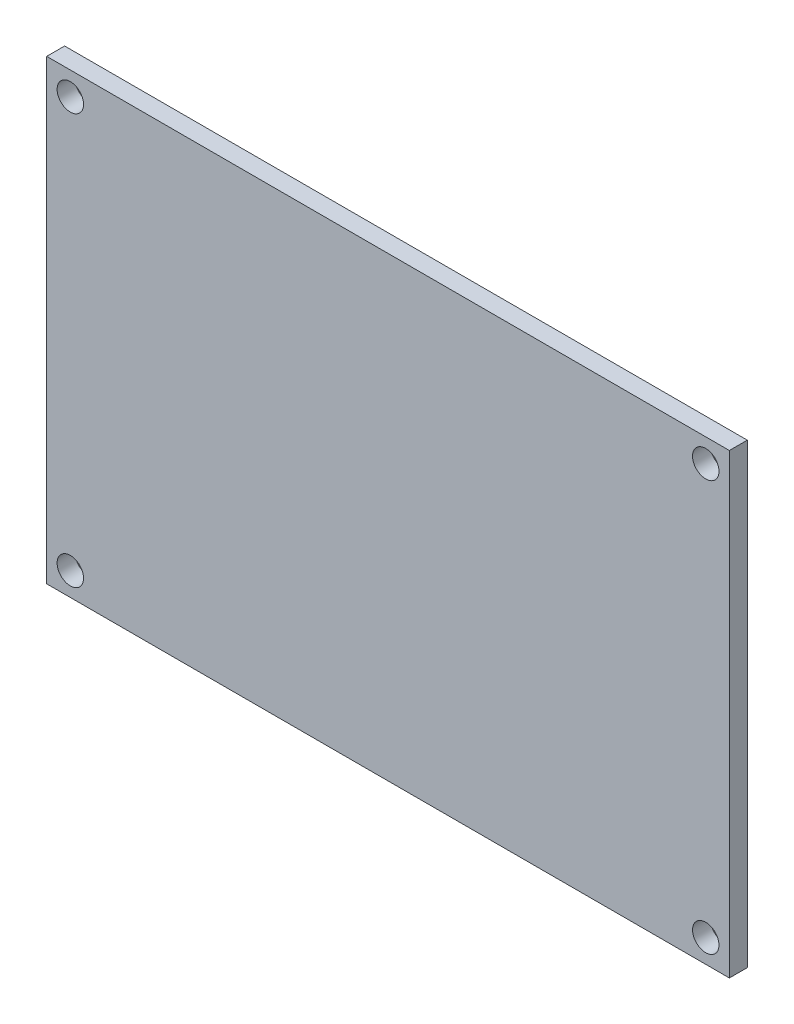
ISO-10303-21;
HEADER;
FILE_DESCRIPTION(('STEP AP214'),'2;1');
FILE_NAME('part.step','',(''),(''),'','','');
FILE_SCHEMA(('AUTOMOTIVE_DESIGN { 1 0 10303 214 1 1 1 1 }'));
ENDSEC;
DATA;
#1=APPLICATION_CONTEXT('core data for automotive mechanical design processes');
#2=APPLICATION_PROTOCOL_DEFINITION('international standard','automotive_design',2000,#1);
#3=PRODUCT_CONTEXT('',#1,'mechanical');
#4=PRODUCT('Part','Part','',(#3));
#5=PRODUCT_RELATED_PRODUCT_CATEGORY('part','',(#4));
#6=PRODUCT_DEFINITION_FORMATION('','',#4);
#7=PRODUCT_DEFINITION_CONTEXT('part definition',#1,'design');
#8=PRODUCT_DEFINITION('design','',#6,#7);
#9=PRODUCT_DEFINITION_SHAPE('','',#8);
#10=(LENGTH_UNIT() NAMED_UNIT(*) SI_UNIT(.MILLI.,.METRE.));
#11=(NAMED_UNIT(*) PLANE_ANGLE_UNIT() SI_UNIT($,.RADIAN.));
#12=(NAMED_UNIT(*) SI_UNIT($,.STERADIAN.) SOLID_ANGLE_UNIT());
#13=UNCERTAINTY_MEASURE_WITH_UNIT(LENGTH_MEASURE(1.E-05),#10,'distance_accuracy_value','');
#14=(GEOMETRIC_REPRESENTATION_CONTEXT(3) GLOBAL_UNCERTAINTY_ASSIGNED_CONTEXT((#13)) GLOBAL_UNIT_ASSIGNED_CONTEXT((#10,
#11,#12)) REPRESENTATION_CONTEXT('',''));
#15=CARTESIAN_POINT('',(0.,0.,0.));
#16=DIRECTION('',(0.,0.,1.));
#17=DIRECTION('',(1.,0.,0.));
#18=AXIS2_PLACEMENT_3D('',#15,#16,#17);
#19=CARTESIAN_POINT('',(0.,0.,1.5748));
#20=DIRECTION('',(0.,0.,1.));
#21=DIRECTION('',(1.,0.,0.));
#22=AXIS2_PLACEMENT_3D('',#19,#20,#21);
#23=PLANE('',#22);
#24=CARTESIAN_POINT('',(-27.9273,-18.034,1.5748));
#25=DIRECTION('',(0.,0.,1.));
#26=DIRECTION('',(1.,0.,0.));
#27=AXIS2_PLACEMENT_3D('',#24,#25,#26);
#28=CIRCLE('',#27,1.16205);
#29=CARTESIAN_POINT('',(-26.76525,-18.034,1.5748));
#30=VERTEX_POINT('',#29);
#31=EDGE_CURVE('E141',#30,#30,#28,.T.);
#32=ORIENTED_EDGE('',*,*,#31,.F.);
#33=EDGE_LOOP('',(#32));
#34=FACE_BOUND('',#33,.T.);
#35=CARTESIAN_POINT('',(27.9273,18.034,1.5748));
#36=DIRECTION('',(0.,0.,1.));
#37=DIRECTION('',(1.,0.,0.));
#38=AXIS2_PLACEMENT_3D('',#35,#36,#37);
#39=CIRCLE('',#38,1.16205);
#40=CARTESIAN_POINT('',(29.08935,18.034,1.5748));
#41=VERTEX_POINT('',#40);
#42=EDGE_CURVE('E115',#41,#41,#39,.T.);
#43=ORIENTED_EDGE('',*,*,#42,.F.);
#44=EDGE_LOOP('',(#43));
#45=FACE_BOUND('',#44,.T.);
#46=DIRECTION('',(0.,-1.,0.));
#47=VECTOR('',#46,1.);
#48=CARTESIAN_POINT('',(-30.00375,20.0787,1.5748));
#49=LINE('',#48,#47);
#50=CARTESIAN_POINT('',(-30.00375,20.0787,1.5748));
#51=VERTEX_POINT('',#50);
#52=CARTESIAN_POINT('',(-30.00375,-20.0787,1.5748));
#53=VERTEX_POINT('',#52);
#54=EDGE_CURVE('E94',#51,#53,#49,.T.);
#55=ORIENTED_EDGE('',*,*,#54,.T.);
#56=DIRECTION('',(1.,0.,0.));
#57=VECTOR('',#56,1.);
#58=CARTESIAN_POINT('',(-30.00375,-20.0787,1.5748));
#59=LINE('',#58,#57);
#60=CARTESIAN_POINT('',(30.00375,-20.0787,1.5748));
#61=VERTEX_POINT('',#60);
#62=EDGE_CURVE('E88',#53,#61,#59,.T.);
#63=ORIENTED_EDGE('',*,*,#62,.T.);
#64=DIRECTION('',(0.,1.,0.));
#65=VECTOR('',#64,1.);
#66=CARTESIAN_POINT('',(30.00375,20.0787,1.5748));
#67=LINE('',#66,#65);
#68=CARTESIAN_POINT('',(30.00375,20.0787,1.5748));
#69=VERTEX_POINT('',#68);
#70=EDGE_CURVE('E92',#61,#69,#67,.T.);
#71=ORIENTED_EDGE('',*,*,#70,.T.);
#72=DIRECTION('',(-1.,0.,0.));
#73=VECTOR('',#72,1.);
#74=CARTESIAN_POINT('',(-30.00375,20.0787,1.5748));
#75=LINE('',#74,#73);
#76=EDGE_CURVE('E55',#69,#51,#75,.T.);
#77=ORIENTED_EDGE('',*,*,#76,.T.);
#78=EDGE_LOOP('',(#55,#63,#71,#77));
#79=FACE_BOUND('',#78,.T.);
#80=CARTESIAN_POINT('',(27.9273,-18.034,1.5748));
#81=DIRECTION('',(0.,0.,1.));
#82=DIRECTION('',(1.,0.,0.));
#83=AXIS2_PLACEMENT_3D('',#80,#81,#82);
#84=CIRCLE('',#83,1.16205000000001);
#85=CARTESIAN_POINT('',(29.08935,-18.034,1.5748));
#86=VERTEX_POINT('',#85);
#87=EDGE_CURVE('E135',#86,#86,#84,.T.);
#88=ORIENTED_EDGE('',*,*,#87,.F.);
#89=EDGE_LOOP('',(#88));
#90=FACE_BOUND('',#89,.T.);
#91=CARTESIAN_POINT('',(-27.9273,18.034,1.5748));
#92=DIRECTION('',(0.,0.,1.));
#93=DIRECTION('',(1.,0.,0.));
#94=AXIS2_PLACEMENT_3D('',#91,#92,#93);
#95=CIRCLE('',#94,1.16205);
#96=CARTESIAN_POINT('',(-26.76525,18.034,1.5748));
#97=VERTEX_POINT('',#96);
#98=EDGE_CURVE('E148',#97,#97,#95,.T.);
#99=ORIENTED_EDGE('',*,*,#98,.F.);
#100=EDGE_LOOP('',(#99));
#101=FACE_BOUND('',#100,.T.);
#102=ADVANCED_FACE('F38',(#34,#45,#79,#90,#101),#23,.T.);
#103=CARTESIAN_POINT('',(0.,0.,0.));
#104=DIRECTION('',(0.,0.,1.));
#105=DIRECTION('',(1.,0.,0.));
#106=AXIS2_PLACEMENT_3D('',#103,#104,#105);
#107=PLANE('',#106);
#108=DIRECTION('',(0.,-1.,0.));
#109=VECTOR('',#108,1.);
#110=CARTESIAN_POINT('',(-30.00375,20.0787,0.));
#111=LINE('',#110,#109);
#112=CARTESIAN_POINT('',(-30.00375,20.0787,0.));
#113=VERTEX_POINT('',#112);
#114=CARTESIAN_POINT('',(-30.00375,-20.0787,0.));
#115=VERTEX_POINT('',#114);
#116=EDGE_CURVE('E112',#113,#115,#111,.T.);
#117=ORIENTED_EDGE('',*,*,#116,.F.);
#118=DIRECTION('',(-1.,0.,0.));
#119=VECTOR('',#118,1.);
#120=CARTESIAN_POINT('',(-30.00375,20.0787,0.));
#121=LINE('',#120,#119);
#122=CARTESIAN_POINT('',(30.00375,20.0787,0.));
#123=VERTEX_POINT('',#122);
#124=EDGE_CURVE('E81',#123,#113,#121,.T.);
#125=ORIENTED_EDGE('',*,*,#124,.F.);
#126=DIRECTION('',(0.,1.,0.));
#127=VECTOR('',#126,1.);
#128=CARTESIAN_POINT('',(30.00375,20.0787,0.));
#129=LINE('',#128,#127);
#130=CARTESIAN_POINT('',(30.00375,-20.0787,0.));
#131=VERTEX_POINT('',#130);
#132=EDGE_CURVE('E75',#131,#123,#129,.T.);
#133=ORIENTED_EDGE('',*,*,#132,.F.);
#134=DIRECTION('',(1.,0.,0.));
#135=VECTOR('',#134,1.);
#136=CARTESIAN_POINT('',(-30.00375,-20.0787,0.));
#137=LINE('',#136,#135);
#138=EDGE_CURVE('E99',#115,#131,#137,.T.);
#139=ORIENTED_EDGE('',*,*,#138,.F.);
#140=EDGE_LOOP('',(#117,#125,#133,#139));
#141=FACE_BOUND('',#140,.T.);
#142=CARTESIAN_POINT('',(27.9273,18.034,0.));
#143=DIRECTION('',(0.,0.,1.));
#144=DIRECTION('',(1.,0.,0.));
#145=AXIS2_PLACEMENT_3D('',#142,#143,#144);
#146=CIRCLE('',#145,1.16205);
#147=CARTESIAN_POINT('',(29.08935,18.034,0.));
#148=VERTEX_POINT('',#147);
#149=EDGE_CURVE('E132',#148,#148,#146,.T.);
#150=ORIENTED_EDGE('',*,*,#149,.T.);
#151=EDGE_LOOP('',(#150));
#152=FACE_BOUND('',#151,.T.);
#153=CARTESIAN_POINT('',(27.9273,-18.034,0.));
#154=DIRECTION('',(0.,0.,1.));
#155=DIRECTION('',(1.,0.,0.));
#156=AXIS2_PLACEMENT_3D('',#153,#154,#155);
#157=CIRCLE('',#156,1.16205000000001);
#158=CARTESIAN_POINT('',(29.08935,-18.034,0.));
#159=VERTEX_POINT('',#158);
#160=EDGE_CURVE('E138',#159,#159,#157,.T.);
#161=ORIENTED_EDGE('',*,*,#160,.T.);
#162=EDGE_LOOP('',(#161));
#163=FACE_BOUND('',#162,.T.);
#164=CARTESIAN_POINT('',(-27.9273,-18.034,0.));
#165=DIRECTION('',(0.,0.,1.));
#166=DIRECTION('',(1.,0.,0.));
#167=AXIS2_PLACEMENT_3D('',#164,#165,#166);
#168=CIRCLE('',#167,1.16205);
#169=CARTESIAN_POINT('',(-26.76525,-18.034,0.));
#170=VERTEX_POINT('',#169);
#171=EDGE_CURVE('E145',#170,#170,#168,.T.);
#172=ORIENTED_EDGE('',*,*,#171,.T.);
#173=EDGE_LOOP('',(#172));
#174=FACE_BOUND('',#173,.T.);
#175=CARTESIAN_POINT('',(-27.9273,18.034,0.));
#176=DIRECTION('',(0.,0.,1.));
#177=DIRECTION('',(1.,0.,0.));
#178=AXIS2_PLACEMENT_3D('',#175,#176,#177);
#179=CIRCLE('',#178,1.16205);
#180=CARTESIAN_POINT('',(-26.76525,18.034,0.));
#181=VERTEX_POINT('',#180);
#182=EDGE_CURVE('E151',#181,#181,#179,.T.);
#183=ORIENTED_EDGE('',*,*,#182,.T.);
#184=EDGE_LOOP('',(#183));
#185=FACE_BOUND('',#184,.T.);
#186=ADVANCED_FACE('F128',(#141,#152,#163,#174,#185),#107,.F.);
#187=CARTESIAN_POINT('',(-30.00375,20.0787,1.5748));
#188=DIRECTION('',(1.,0.,0.));
#189=DIRECTION('',(0.,1.,0.));
#190=AXIS2_PLACEMENT_3D('',#187,#188,#189);
#191=PLANE('',#190);
#192=ORIENTED_EDGE('',*,*,#116,.T.);
#193=DIRECTION('',(0.,0.,-1.));
#194=VECTOR('',#193,1.);
#195=CARTESIAN_POINT('',(-30.00375,-20.0787,1.5748));
#196=LINE('',#195,#194);
#197=EDGE_CURVE('E11',#53,#115,#196,.T.);
#198=ORIENTED_EDGE('',*,*,#197,.F.);
#199=ORIENTED_EDGE('',*,*,#54,.F.);
#200=DIRECTION('',(0.,0.,-1.));
#201=VECTOR('',#200,1.);
#202=CARTESIAN_POINT('',(-30.00375,20.0787,1.5748));
#203=LINE('',#202,#201);
#204=EDGE_CURVE('E108',#51,#113,#203,.T.);
#205=ORIENTED_EDGE('',*,*,#204,.T.);
#206=EDGE_LOOP('',(#192,#198,#199,#205));
#207=FACE_BOUND('',#206,.T.);
#208=ADVANCED_FACE('F40',(#207),#191,.F.);
#209=CARTESIAN_POINT('',(-30.00375,-20.0787,1.5748));
#210=DIRECTION('',(0.,1.,0.));
#211=DIRECTION('',(0.,0.,1.));
#212=AXIS2_PLACEMENT_3D('',#209,#210,#211);
#213=PLANE('',#212);
#214=ORIENTED_EDGE('',*,*,#138,.T.);
#215=DIRECTION('',(0.,0.,-1.));
#216=VECTOR('',#215,1.);
#217=CARTESIAN_POINT('',(30.00375,-20.0787,1.5748));
#218=LINE('',#217,#216);
#219=EDGE_CURVE('E47',#61,#131,#218,.T.);
#220=ORIENTED_EDGE('',*,*,#219,.F.);
#221=ORIENTED_EDGE('',*,*,#62,.F.);
#222=ORIENTED_EDGE('',*,*,#197,.T.);
#223=EDGE_LOOP('',(#214,#220,#221,#222));
#224=FACE_BOUND('',#223,.T.);
#225=ADVANCED_FACE('F98',(#224),#213,.F.);
#226=CARTESIAN_POINT('',(30.00375,20.0787,1.5748));
#227=DIRECTION('',(-1.,0.,0.));
#228=DIRECTION('',(0.,-1.,0.));
#229=AXIS2_PLACEMENT_3D('',#226,#227,#228);
#230=PLANE('',#229);
#231=ORIENTED_EDGE('',*,*,#132,.T.);
#232=DIRECTION('',(0.,0.,-1.));
#233=VECTOR('',#232,1.);
#234=CARTESIAN_POINT('',(30.00375,20.0787,1.5748));
#235=LINE('',#234,#233);
#236=EDGE_CURVE('E101',#69,#123,#235,.T.);
#237=ORIENTED_EDGE('',*,*,#236,.F.);
#238=ORIENTED_EDGE('',*,*,#70,.F.);
#239=ORIENTED_EDGE('',*,*,#219,.T.);
#240=EDGE_LOOP('',(#231,#237,#238,#239));
#241=FACE_BOUND('',#240,.T.);
#242=ADVANCED_FACE('F102',(#241),#230,.F.);
#243=CARTESIAN_POINT('',(-30.00375,20.0787,1.5748));
#244=DIRECTION('',(0.,-1.,0.));
#245=DIRECTION('',(0.,0.,-1.));
#246=AXIS2_PLACEMENT_3D('',#243,#244,#245);
#247=PLANE('',#246);
#248=ORIENTED_EDGE('',*,*,#124,.T.);
#249=ORIENTED_EDGE('',*,*,#204,.F.);
#250=ORIENTED_EDGE('',*,*,#76,.F.);
#251=ORIENTED_EDGE('',*,*,#236,.T.);
#252=EDGE_LOOP('',(#248,#249,#250,#251));
#253=FACE_BOUND('',#252,.T.);
#254=ADVANCED_FACE('F125',(#253),#247,.F.);
#255=CARTESIAN_POINT('',(27.9273,18.034,1.5748));
#256=DIRECTION('',(0.,0.,-1.));
#257=DIRECTION('',(-1.,0.,0.));
#258=AXIS2_PLACEMENT_3D('',#255,#256,#257);
#259=CYLINDRICAL_SURFACE('',#258,1.16205);
#260=ORIENTED_EDGE('',*,*,#42,.T.);
#261=EDGE_LOOP('',(#260));
#262=FACE_BOUND('',#261,.T.);
#263=ORIENTED_EDGE('',*,*,#149,.F.);
#264=EDGE_LOOP('',(#263));
#265=FACE_BOUND('',#264,.T.);
#266=ADVANCED_FACE('F170',(#262,#265),#259,.F.);
#267=CARTESIAN_POINT('',(27.9273,-18.034,1.5748));
#268=DIRECTION('',(0.,0.,-1.));
#269=DIRECTION('',(-1.,0.,0.));
#270=AXIS2_PLACEMENT_3D('',#267,#268,#269);
#271=CYLINDRICAL_SURFACE('',#270,1.16205000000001);
#272=ORIENTED_EDGE('',*,*,#87,.T.);
#273=EDGE_LOOP('',(#272));
#274=FACE_BOUND('',#273,.T.);
#275=ORIENTED_EDGE('',*,*,#160,.F.);
#276=EDGE_LOOP('',(#275));
#277=FACE_BOUND('',#276,.T.);
#278=ADVANCED_FACE('F218',(#274,#277),#271,.F.);
#279=CARTESIAN_POINT('',(-27.9273,-18.034,1.5748));
#280=DIRECTION('',(0.,0.,-1.));
#281=DIRECTION('',(-1.,0.,0.));
#282=AXIS2_PLACEMENT_3D('',#279,#280,#281);
#283=CYLINDRICAL_SURFACE('',#282,1.16205);
#284=ORIENTED_EDGE('',*,*,#31,.T.);
#285=EDGE_LOOP('',(#284));
#286=FACE_BOUND('',#285,.T.);
#287=ORIENTED_EDGE('',*,*,#171,.F.);
#288=EDGE_LOOP('',(#287));
#289=FACE_BOUND('',#288,.T.);
#290=ADVANCED_FACE('F226',(#286,#289),#283,.F.);
#291=CARTESIAN_POINT('',(-27.9273,18.034,1.5748));
#292=DIRECTION('',(0.,0.,-1.));
#293=DIRECTION('',(-1.,0.,0.));
#294=AXIS2_PLACEMENT_3D('',#291,#292,#293);
#295=CYLINDRICAL_SURFACE('',#294,1.16205);
#296=ORIENTED_EDGE('',*,*,#98,.T.);
#297=EDGE_LOOP('',(#296));
#298=FACE_BOUND('',#297,.T.);
#299=ORIENTED_EDGE('',*,*,#182,.F.);
#300=EDGE_LOOP('',(#299));
#301=FACE_BOUND('',#300,.T.);
#302=ADVANCED_FACE('F157',(#298,#301),#295,.F.);
#303=CLOSED_SHELL('',(#102,#186,#208,#225,#242,#254,#266,#278,#290,#302));
#304=MANIFOLD_SOLID_BREP('B2',#303);
#305=ADVANCED_BREP_SHAPE_REPRESENTATION('',(#18,#304),#14);
#306=SHAPE_DEFINITION_REPRESENTATION(#9,#305);
ENDSEC;
END-ISO-10303-21;
